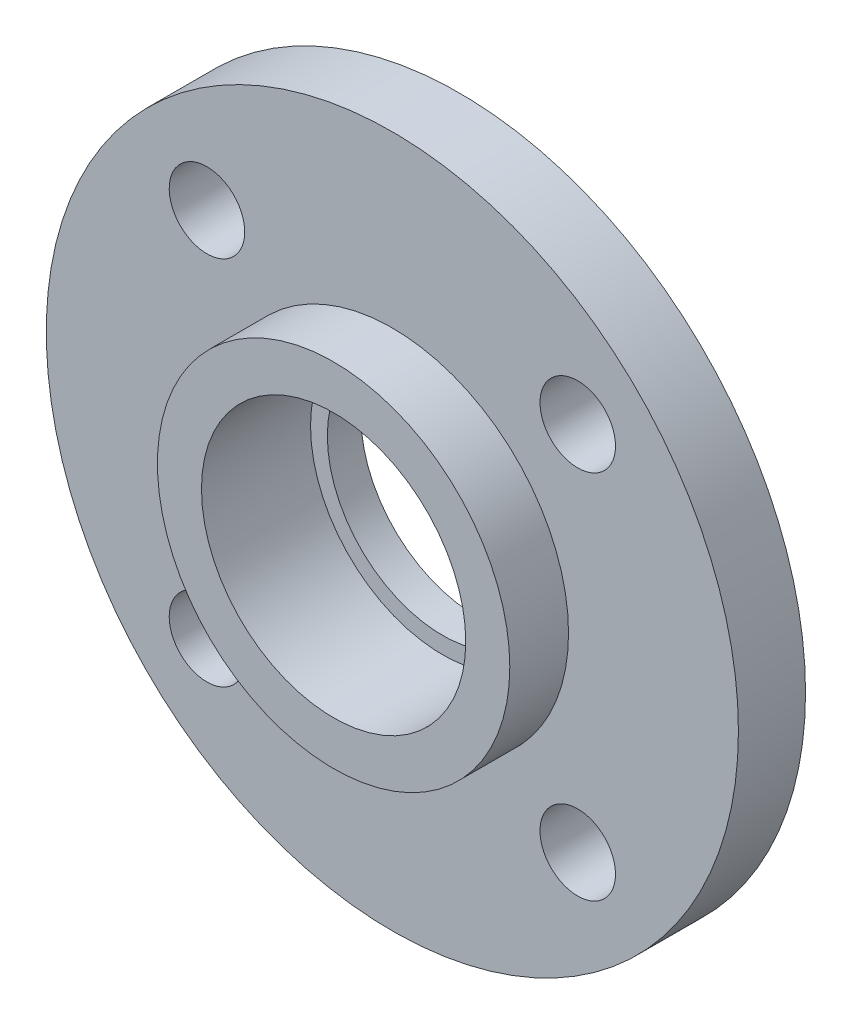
ISO-10303-21;
HEADER;
FILE_DESCRIPTION(('STEP AP214'),'2;1');
FILE_NAME('part.step','',(''),(''),'','','');
FILE_SCHEMA(('AUTOMOTIVE_DESIGN { 1 0 10303 214 1 1 1 1 }'));
ENDSEC;
DATA;
#1=APPLICATION_CONTEXT('core data for automotive mechanical design processes');
#2=APPLICATION_PROTOCOL_DEFINITION('international standard','automotive_design',2000,#1);
#3=PRODUCT_CONTEXT('',#1,'mechanical');
#4=PRODUCT('Part','Part','',(#3));
#5=PRODUCT_RELATED_PRODUCT_CATEGORY('part','',(#4));
#6=PRODUCT_DEFINITION_FORMATION('','',#4);
#7=PRODUCT_DEFINITION_CONTEXT('part definition',#1,'design');
#8=PRODUCT_DEFINITION('design','',#6,#7);
#9=PRODUCT_DEFINITION_SHAPE('','',#8);
#10=(LENGTH_UNIT() NAMED_UNIT(*) SI_UNIT(.MILLI.,.METRE.));
#11=(NAMED_UNIT(*) PLANE_ANGLE_UNIT() SI_UNIT($,.RADIAN.));
#12=(NAMED_UNIT(*) SI_UNIT($,.STERADIAN.) SOLID_ANGLE_UNIT());
#13=UNCERTAINTY_MEASURE_WITH_UNIT(LENGTH_MEASURE(1.E-05),#10,'distance_accuracy_value','');
#14=(GEOMETRIC_REPRESENTATION_CONTEXT(3) GLOBAL_UNCERTAINTY_ASSIGNED_CONTEXT((#13)) GLOBAL_UNIT_ASSIGNED_CONTEXT((#10,
#11,#12)) REPRESENTATION_CONTEXT('',''));
#15=CARTESIAN_POINT('',(0.,0.,0.));
#16=DIRECTION('',(0.,0.,1.));
#17=DIRECTION('',(1.,0.,0.));
#18=AXIS2_PLACEMENT_3D('',#15,#16,#17);
#19=CARTESIAN_POINT('',(0.,0.,-20.));
#20=DIRECTION('',(0.,0.,1.));
#21=DIRECTION('',(1.,0.,0.));
#22=AXIS2_PLACEMENT_3D('',#19,#20,#21);
#23=CYLINDRICAL_SURFACE('',#22,82.5);
#24=CARTESIAN_POINT('',(0.,0.,0.));
#25=DIRECTION('',(0.,0.,1.));
#26=DIRECTION('',(1.,0.,0.));
#27=AXIS2_PLACEMENT_3D('',#24,#25,#26);
#28=CIRCLE('',#27,82.5);
#29=CARTESIAN_POINT('',(82.5,0.,0.));
#30=VERTEX_POINT('',#29);
#31=EDGE_CURVE('E11',#30,#30,#28,.T.);
#32=ORIENTED_EDGE('',*,*,#31,.F.);
#33=EDGE_LOOP('',(#32));
#34=FACE_BOUND('',#33,.T.);
#35=CARTESIAN_POINT('',(0.,0.,-16.));
#36=DIRECTION('',(0.,0.,-1.));
#37=DIRECTION('',(-1.,0.,0.));
#38=AXIS2_PLACEMENT_3D('',#35,#36,#37);
#39=CIRCLE('',#38,82.5);
#40=CARTESIAN_POINT('',(-82.5,0.,-16.));
#41=VERTEX_POINT('',#40);
#42=EDGE_CURVE('E47',#41,#41,#39,.F.);
#43=ORIENTED_EDGE('',*,*,#42,.T.);
#44=EDGE_LOOP('',(#43));
#45=FACE_BOUND('',#44,.T.);
#46=ADVANCED_FACE('F30',(#34,#45),#23,.T.);
#47=CARTESIAN_POINT('',(0.,0.,0.));
#48=DIRECTION('',(0.,0.,1.));
#49=DIRECTION('',(1.,0.,0.));
#50=AXIS2_PLACEMENT_3D('',#47,#48,#49);
#51=PLANE('',#50);
#52=CARTESIAN_POINT('',(44.1941738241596,-44.1941738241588,0.));
#53=DIRECTION('',(0.,0.,1.));
#54=DIRECTION('',(0.,-1.,0.));
#55=AXIS2_PLACEMENT_3D('',#52,#53,#54);
#56=CIRCLE('',#55,9.);
#57=CARTESIAN_POINT('',(44.1941738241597,-53.1941738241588,0.));
#58=VERTEX_POINT('',#57);
#59=EDGE_CURVE('E71',#58,#58,#56,.T.);
#60=ORIENTED_EDGE('',*,*,#59,.F.);
#61=EDGE_LOOP('',(#60));
#62=FACE_BOUND('',#61,.T.);
#63=CARTESIAN_POINT('',(-44.194173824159,-44.1941738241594,0.));
#64=DIRECTION('',(0.,0.,1.));
#65=DIRECTION('',(-1.,0.,0.));
#66=AXIS2_PLACEMENT_3D('',#63,#64,#65);
#67=CIRCLE('',#66,9.);
#68=CARTESIAN_POINT('',(-53.194173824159,-44.1941738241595,0.));
#69=VERTEX_POINT('',#68);
#70=EDGE_CURVE('E61',#69,#69,#67,.T.);
#71=ORIENTED_EDGE('',*,*,#70,.F.);
#72=EDGE_LOOP('',(#71));
#73=FACE_BOUND('',#72,.T.);
#74=CARTESIAN_POINT('',(-44.1941738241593,44.1941738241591,0.));
#75=DIRECTION('',(0.,0.,1.));
#76=DIRECTION('',(0.,1.,0.));
#77=AXIS2_PLACEMENT_3D('',#74,#75,#76);
#78=CIRCLE('',#77,9.);
#79=CARTESIAN_POINT('',(-44.1941738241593,53.1941738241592,0.));
#80=VERTEX_POINT('',#79);
#81=EDGE_CURVE('E58',#80,#80,#78,.T.);
#82=ORIENTED_EDGE('',*,*,#81,.F.);
#83=EDGE_LOOP('',(#82));
#84=FACE_BOUND('',#83,.T.);
#85=CARTESIAN_POINT('',(44.1941738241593,44.1941738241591,0.));
#86=DIRECTION('',(0.,0.,1.));
#87=DIRECTION('',(1.,0.,0.));
#88=AXIS2_PLACEMENT_3D('',#85,#86,#87);
#89=CIRCLE('',#88,9.);
#90=CARTESIAN_POINT('',(53.1941738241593,44.1941738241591,0.));
#91=VERTEX_POINT('',#90);
#92=EDGE_CURVE('E55',#91,#91,#89,.T.);
#93=ORIENTED_EDGE('',*,*,#92,.F.);
#94=EDGE_LOOP('',(#93));
#95=FACE_BOUND('',#94,.T.);
#96=ORIENTED_EDGE('',*,*,#31,.T.);
#97=EDGE_LOOP('',(#96));
#98=FACE_BOUND('',#97,.T.);
#99=CARTESIAN_POINT('',(0.,0.,0.));
#100=DIRECTION('',(0.,0.,1.));
#101=DIRECTION('',(1.,0.,0.));
#102=AXIS2_PLACEMENT_3D('',#99,#100,#101);
#103=CIRCLE('',#102,42.);
#104=CARTESIAN_POINT('',(42.,0.,0.));
#105=VERTEX_POINT('',#104);
#106=EDGE_CURVE('E37',#105,#105,#103,.F.);
#107=ORIENTED_EDGE('',*,*,#106,.T.);
#108=EDGE_LOOP('',(#107));
#109=FACE_BOUND('',#108,.T.);
#110=ADVANCED_FACE('F111',(#62,#73,#84,#95,#98,#109),#51,.T.);
#111=CARTESIAN_POINT('',(0.,0.,14.));
#112=DIRECTION('',(0.,0.,-1.));
#113=DIRECTION('',(-1.,0.,0.));
#114=AXIS2_PLACEMENT_3D('',#111,#112,#113);
#115=CYLINDRICAL_SURFACE('',#114,42.);
#116=ORIENTED_EDGE('',*,*,#106,.F.);
#117=EDGE_LOOP('',(#116));
#118=FACE_BOUND('',#117,.T.);
#119=CARTESIAN_POINT('',(0.,0.,14.));
#120=DIRECTION('',(0.,0.,1.));
#121=DIRECTION('',(1.,0.,0.));
#122=AXIS2_PLACEMENT_3D('',#119,#120,#121);
#123=CIRCLE('',#122,42.);
#124=CARTESIAN_POINT('',(42.,0.,14.));
#125=VERTEX_POINT('',#124);
#126=EDGE_CURVE('E42',#125,#125,#123,.T.);
#127=ORIENTED_EDGE('',*,*,#126,.F.);
#128=EDGE_LOOP('',(#127));
#129=FACE_BOUND('',#128,.T.);
#130=ADVANCED_FACE('F116',(#118,#129),#115,.T.);
#131=CARTESIAN_POINT('',(0.,0.,14.));
#132=DIRECTION('',(0.,0.,1.));
#133=DIRECTION('',(1.,0.,0.));
#134=AXIS2_PLACEMENT_3D('',#131,#132,#133);
#135=PLANE('',#134);
#136=CARTESIAN_POINT('',(0.,0.,14.));
#137=DIRECTION('',(0.,0.,-1.));
#138=DIRECTION('',(-1.,0.,0.));
#139=AXIS2_PLACEMENT_3D('',#136,#137,#138);
#140=CIRCLE('',#139,31.5);
#141=CARTESIAN_POINT('',(-31.5,0.,14.));
#142=VERTEX_POINT('',#141);
#143=EDGE_CURVE('E76',#142,#142,#140,.T.);
#144=ORIENTED_EDGE('',*,*,#143,.T.);
#145=EDGE_LOOP('',(#144));
#146=FACE_BOUND('',#145,.T.);
#147=ORIENTED_EDGE('',*,*,#126,.T.);
#148=EDGE_LOOP('',(#147));
#149=FACE_BOUND('',#148,.T.);
#150=ADVANCED_FACE('F106',(#146,#149),#135,.T.);
#151=CARTESIAN_POINT('',(0.,0.,-16.));
#152=DIRECTION('',(0.,0.,-1.));
#153=DIRECTION('',(-1.,0.,0.));
#154=AXIS2_PLACEMENT_3D('',#151,#152,#153);
#155=PLANE('',#154);
#156=CARTESIAN_POINT('',(44.1941738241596,-44.1941738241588,-16.));
#157=DIRECTION('',(0.,0.,-1.));
#158=DIRECTION('',(-1.,0.,0.));
#159=AXIS2_PLACEMENT_3D('',#156,#157,#158);
#160=CIRCLE('',#159,9.);
#161=CARTESIAN_POINT('',(35.1941738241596,-44.1941738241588,-16.));
#162=VERTEX_POINT('',#161);
#163=EDGE_CURVE('E33',#162,#162,#160,.T.);
#164=ORIENTED_EDGE('',*,*,#163,.F.);
#165=EDGE_LOOP('',(#164));
#166=FACE_BOUND('',#165,.T.);
#167=CARTESIAN_POINT('',(-44.194173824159,-44.1941738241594,-16.));
#168=DIRECTION('',(0.,0.,-1.));
#169=DIRECTION('',(-1.,0.,0.));
#170=AXIS2_PLACEMENT_3D('',#167,#168,#169);
#171=CIRCLE('',#170,9.);
#172=CARTESIAN_POINT('',(-53.194173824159,-44.1941738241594,-16.));
#173=VERTEX_POINT('',#172);
#174=EDGE_CURVE('E59',#173,#173,#171,.T.);
#175=ORIENTED_EDGE('',*,*,#174,.F.);
#176=EDGE_LOOP('',(#175));
#177=FACE_BOUND('',#176,.T.);
#178=CARTESIAN_POINT('',(-44.1941738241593,44.1941738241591,-16.));
#179=DIRECTION('',(0.,0.,-1.));
#180=DIRECTION('',(-1.,0.,0.));
#181=AXIS2_PLACEMENT_3D('',#178,#179,#180);
#182=CIRCLE('',#181,9.);
#183=CARTESIAN_POINT('',(-53.1941738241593,44.1941738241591,-16.));
#184=VERTEX_POINT('',#183);
#185=EDGE_CURVE('E56',#184,#184,#182,.T.);
#186=ORIENTED_EDGE('',*,*,#185,.F.);
#187=EDGE_LOOP('',(#186));
#188=FACE_BOUND('',#187,.T.);
#189=CARTESIAN_POINT('',(44.1941738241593,44.1941738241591,-16.));
#190=DIRECTION('',(0.,0.,-1.));
#191=DIRECTION('',(-1.,0.,0.));
#192=AXIS2_PLACEMENT_3D('',#189,#190,#191);
#193=CIRCLE('',#192,9.);
#194=CARTESIAN_POINT('',(35.1941738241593,44.1941738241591,-16.));
#195=VERTEX_POINT('',#194);
#196=EDGE_CURVE('E51',#195,#195,#193,.T.);
#197=ORIENTED_EDGE('',*,*,#196,.F.);
#198=EDGE_LOOP('',(#197));
#199=FACE_BOUND('',#198,.T.);
#200=ORIENTED_EDGE('',*,*,#42,.F.);
#201=EDGE_LOOP('',(#200));
#202=FACE_BOUND('',#201,.T.);
#203=CARTESIAN_POINT('',(0.,0.,-16.));
#204=DIRECTION('',(0.,0.,-1.));
#205=DIRECTION('',(-1.,0.,0.));
#206=AXIS2_PLACEMENT_3D('',#203,#204,#205);
#207=CIRCLE('',#206,49.5);
#208=CARTESIAN_POINT('',(-49.5,0.,-16.));
#209=VERTEX_POINT('',#208);
#210=EDGE_CURVE('E50',#209,#209,#207,.T.);
#211=ORIENTED_EDGE('',*,*,#210,.F.);
#212=EDGE_LOOP('',(#211));
#213=FACE_BOUND('',#212,.T.);
#214=ADVANCED_FACE('F96',(#166,#177,#188,#199,#202,#213),#155,.T.);
#215=CARTESIAN_POINT('',(0.,0.,-16.));
#216=DIRECTION('',(0.,0.,-1.));
#217=DIRECTION('',(-1.,0.,0.));
#218=AXIS2_PLACEMENT_3D('',#215,#216,#217);
#219=CYLINDRICAL_SURFACE('',#218,49.5);
#220=ORIENTED_EDGE('',*,*,#210,.T.);
#221=EDGE_LOOP('',(#220));
#222=FACE_BOUND('',#221,.T.);
#223=CARTESIAN_POINT('',(0.,0.,-20.));
#224=DIRECTION('',(0.,0.,-1.));
#225=DIRECTION('',(-1.,0.,0.));
#226=AXIS2_PLACEMENT_3D('',#223,#224,#225);
#227=CIRCLE('',#226,49.5);
#228=CARTESIAN_POINT('',(-49.5,0.,-20.));
#229=VERTEX_POINT('',#228);
#230=EDGE_CURVE('E87',#229,#229,#227,.T.);
#231=ORIENTED_EDGE('',*,*,#230,.F.);
#232=EDGE_LOOP('',(#231));
#233=FACE_BOUND('',#232,.T.);
#234=ADVANCED_FACE('F94',(#222,#233),#219,.T.);
#235=CARTESIAN_POINT('',(0.,0.,-20.));
#236=DIRECTION('',(0.,0.,1.));
#237=DIRECTION('',(1.,0.,0.));
#238=AXIS2_PLACEMENT_3D('',#235,#236,#237);
#239=PLANE('',#238);
#240=CARTESIAN_POINT('',(0.,0.,-20.));
#241=DIRECTION('',(0.,0.,-1.));
#242=DIRECTION('',(-1.,0.,0.));
#243=AXIS2_PLACEMENT_3D('',#240,#241,#242);
#244=CIRCLE('',#243,27.5);
#245=CARTESIAN_POINT('',(-27.5,0.,-20.));
#246=VERTEX_POINT('',#245);
#247=EDGE_CURVE('E84',#246,#246,#244,.T.);
#248=ORIENTED_EDGE('',*,*,#247,.F.);
#249=EDGE_LOOP('',(#248));
#250=FACE_BOUND('',#249,.T.);
#251=ORIENTED_EDGE('',*,*,#230,.T.);
#252=EDGE_LOOP('',(#251));
#253=FACE_BOUND('',#252,.T.);
#254=ADVANCED_FACE('F92',(#250,#253),#239,.F.);
#255=CARTESIAN_POINT('',(0.,0.,-12.));
#256=DIRECTION('',(0.,0.,-1.));
#257=DIRECTION('',(-1.,0.,0.));
#258=AXIS2_PLACEMENT_3D('',#255,#256,#257);
#259=CYLINDRICAL_SURFACE('',#258,27.5);
#260=CARTESIAN_POINT('',(0.,0.,-12.));
#261=DIRECTION('',(0.,0.,-1.));
#262=DIRECTION('',(-1.,0.,0.));
#263=AXIS2_PLACEMENT_3D('',#260,#261,#262);
#264=CIRCLE('',#263,27.5);
#265=CARTESIAN_POINT('',(-27.5,0.,-12.));
#266=VERTEX_POINT('',#265);
#267=EDGE_CURVE('E79',#266,#266,#264,.F.);
#268=ORIENTED_EDGE('',*,*,#267,.T.);
#269=EDGE_LOOP('',(#268));
#270=FACE_BOUND('',#269,.T.);
#271=ORIENTED_EDGE('',*,*,#247,.T.);
#272=EDGE_LOOP('',(#271));
#273=FACE_BOUND('',#272,.T.);
#274=ADVANCED_FACE('F103',(#270,#273),#259,.F.);
#275=CARTESIAN_POINT('',(0.,0.,-12.));
#276=DIRECTION('',(0.,0.,-1.));
#277=DIRECTION('',(-1.,0.,0.));
#278=AXIS2_PLACEMENT_3D('',#275,#276,#277);
#279=PLANE('',#278);
#280=CARTESIAN_POINT('',(0.,0.,-12.));
#281=DIRECTION('',(0.,0.,-1.));
#282=DIRECTION('',(-1.,0.,0.));
#283=AXIS2_PLACEMENT_3D('',#280,#281,#282);
#284=CIRCLE('',#283,31.5);
#285=CARTESIAN_POINT('',(-31.5,0.,-12.));
#286=VERTEX_POINT('',#285);
#287=EDGE_CURVE('E54',#286,#286,#284,.T.);
#288=ORIENTED_EDGE('',*,*,#287,.F.);
#289=EDGE_LOOP('',(#288));
#290=FACE_BOUND('',#289,.T.);
#291=ORIENTED_EDGE('',*,*,#267,.F.);
#292=EDGE_LOOP('',(#291));
#293=FACE_BOUND('',#292,.T.);
#294=ADVANCED_FACE('F145',(#290,#293),#279,.F.);
#295=CARTESIAN_POINT('',(0.,0.,14.));
#296=DIRECTION('',(0.,0.,-1.));
#297=DIRECTION('',(-1.,0.,0.));
#298=AXIS2_PLACEMENT_3D('',#295,#296,#297);
#299=CYLINDRICAL_SURFACE('',#298,31.5);
#300=ORIENTED_EDGE('',*,*,#143,.F.);
#301=EDGE_LOOP('',(#300));
#302=FACE_BOUND('',#301,.T.);
#303=ORIENTED_EDGE('',*,*,#287,.T.);
#304=EDGE_LOOP('',(#303));
#305=FACE_BOUND('',#304,.T.);
#306=ADVANCED_FACE('F141',(#302,#305),#299,.F.);
#307=CARTESIAN_POINT('',(44.1941738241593,44.1941738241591,-20.));
#308=DIRECTION('',(0.,0.,1.));
#309=DIRECTION('',(1.,0.,0.));
#310=AXIS2_PLACEMENT_3D('',#307,#308,#309);
#311=CYLINDRICAL_SURFACE('',#310,9.);
#312=ORIENTED_EDGE('',*,*,#196,.T.);
#313=EDGE_LOOP('',(#312));
#314=FACE_BOUND('',#313,.T.);
#315=ORIENTED_EDGE('',*,*,#92,.T.);
#316=EDGE_LOOP('',(#315));
#317=FACE_BOUND('',#316,.T.);
#318=ADVANCED_FACE('F144',(#314,#317),#311,.F.);
#319=CARTESIAN_POINT('',(-44.1941738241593,44.1941738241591,-20.));
#320=DIRECTION('',(0.,0.,1.));
#321=DIRECTION('',(1.,0.,0.));
#322=AXIS2_PLACEMENT_3D('',#319,#320,#321);
#323=CYLINDRICAL_SURFACE('',#322,9.);
#324=ORIENTED_EDGE('',*,*,#185,.T.);
#325=EDGE_LOOP('',(#324));
#326=FACE_BOUND('',#325,.T.);
#327=ORIENTED_EDGE('',*,*,#81,.T.);
#328=EDGE_LOOP('',(#327));
#329=FACE_BOUND('',#328,.T.);
#330=ADVANCED_FACE('F162',(#326,#329),#323,.F.);
#331=CARTESIAN_POINT('',(-44.194173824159,-44.1941738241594,-20.));
#332=DIRECTION('',(0.,0.,1.));
#333=DIRECTION('',(1.,0.,0.));
#334=AXIS2_PLACEMENT_3D('',#331,#332,#333);
#335=CYLINDRICAL_SURFACE('',#334,9.);
#336=ORIENTED_EDGE('',*,*,#174,.T.);
#337=EDGE_LOOP('',(#336));
#338=FACE_BOUND('',#337,.T.);
#339=ORIENTED_EDGE('',*,*,#70,.T.);
#340=EDGE_LOOP('',(#339));
#341=FACE_BOUND('',#340,.T.);
#342=ADVANCED_FACE('F166',(#338,#341),#335,.F.);
#343=CARTESIAN_POINT('',(44.1941738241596,-44.1941738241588,-20.));
#344=DIRECTION('',(0.,0.,1.));
#345=DIRECTION('',(1.,0.,0.));
#346=AXIS2_PLACEMENT_3D('',#343,#344,#345);
#347=CYLINDRICAL_SURFACE('',#346,9.);
#348=ORIENTED_EDGE('',*,*,#163,.T.);
#349=EDGE_LOOP('',(#348));
#350=FACE_BOUND('',#349,.T.);
#351=ORIENTED_EDGE('',*,*,#59,.T.);
#352=EDGE_LOOP('',(#351));
#353=FACE_BOUND('',#352,.T.);
#354=ADVANCED_FACE('F170',(#350,#353),#347,.F.);
#355=CLOSED_SHELL('',(#46,#110,#130,#150,#214,#234,#254,#274,#294,#306,#318,#330,#342,#354));
#356=MANIFOLD_SOLID_BREP('B2',#355);
#357=ADVANCED_BREP_SHAPE_REPRESENTATION('',(#18,#356),#14);
#358=SHAPE_DEFINITION_REPRESENTATION(#9,#357);
ENDSEC;
END-ISO-10303-21;
